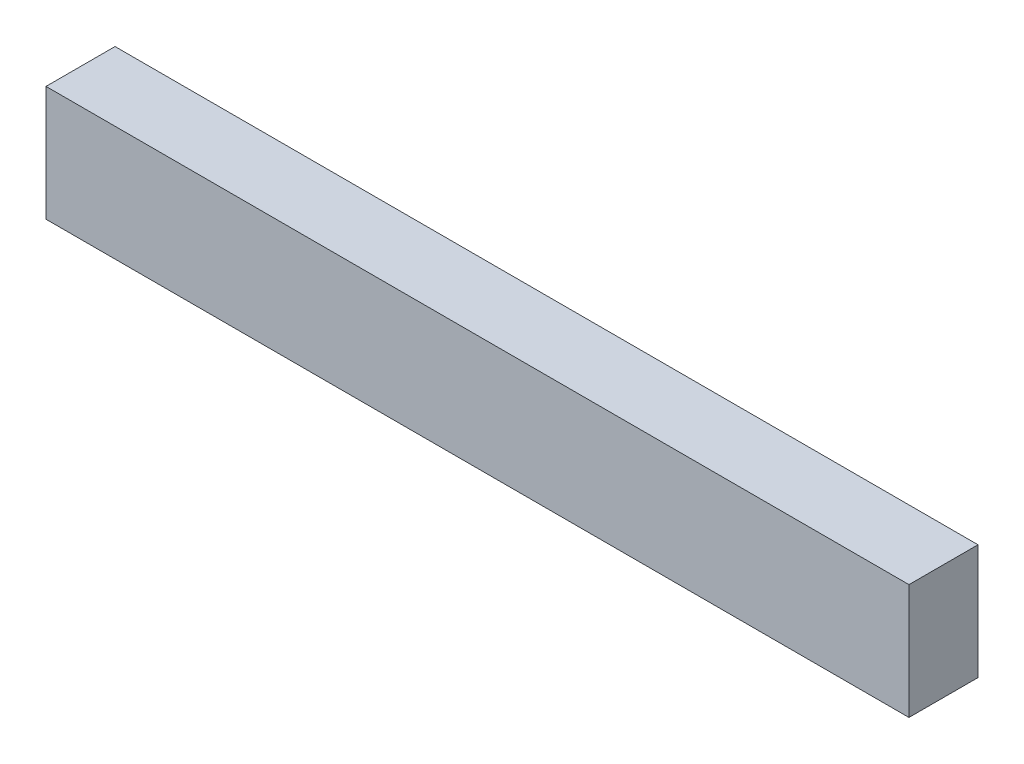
from build123d import *

# Parameters (mm, degrees)
SKETCH1_W           = 525
SKETCH1_H           = 42
BOSS_EXTRUDE2_DEPTH = 70


with BuildPart() as part:
    # Sketch1 → Boss-Extrude2 (new body)
    with BuildSketch(Plane(origin=(0, 0, 0), x_dir=(1, 0, 0), z_dir=(0, 1, 0))):
        with Locations((262.5, 21)):
            Rectangle(SKETCH1_W, SKETCH1_H)
    extrude(amount=BOSS_EXTRUDE2_DEPTH)


solid = part.part
